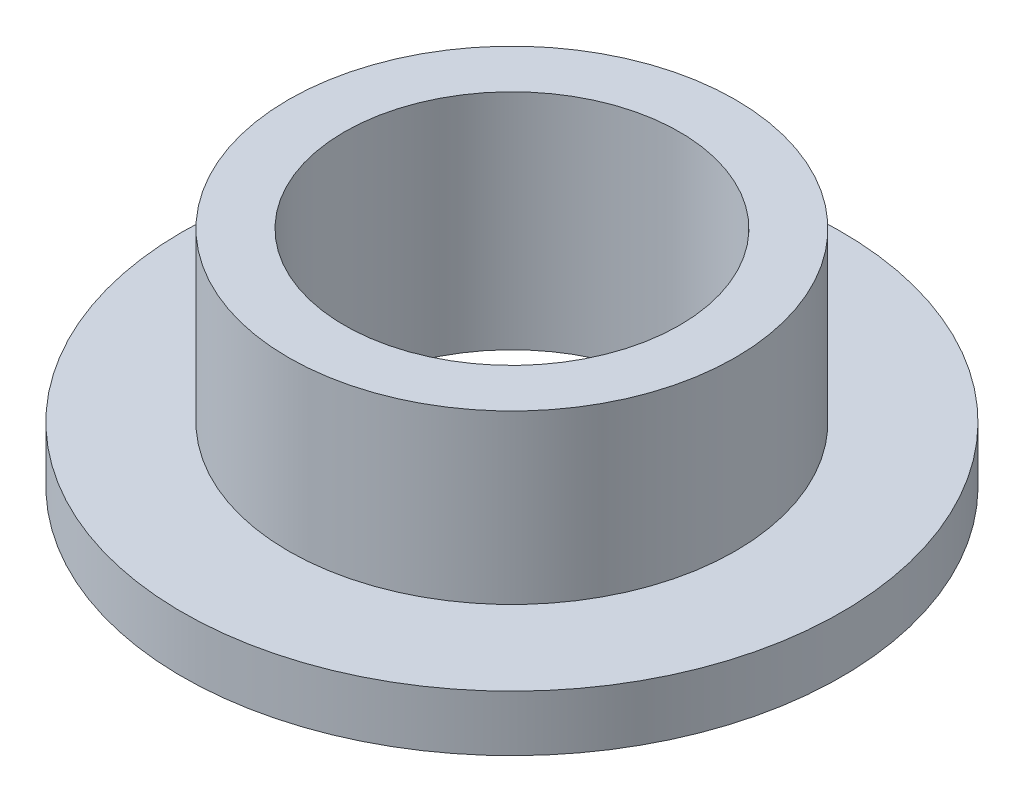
ISO-10303-21;
HEADER;
FILE_DESCRIPTION(('STEP AP214'),'2;1');
FILE_NAME('part.step','',(''),(''),'','','');
FILE_SCHEMA(('AUTOMOTIVE_DESIGN { 1 0 10303 214 1 1 1 1 }'));
ENDSEC;
DATA;
#1=APPLICATION_CONTEXT('core data for automotive mechanical design processes');
#2=APPLICATION_PROTOCOL_DEFINITION('international standard','automotive_design',2000,#1);
#3=PRODUCT_CONTEXT('',#1,'mechanical');
#4=PRODUCT('Part','Part','',(#3));
#5=PRODUCT_RELATED_PRODUCT_CATEGORY('part','',(#4));
#6=PRODUCT_DEFINITION_FORMATION('','',#4);
#7=PRODUCT_DEFINITION_CONTEXT('part definition',#1,'design');
#8=PRODUCT_DEFINITION('design','',#6,#7);
#9=PRODUCT_DEFINITION_SHAPE('','',#8);
#10=(LENGTH_UNIT() NAMED_UNIT(*) SI_UNIT(.MILLI.,.METRE.));
#11=(NAMED_UNIT(*) PLANE_ANGLE_UNIT() SI_UNIT($,.RADIAN.));
#12=(NAMED_UNIT(*) SI_UNIT($,.STERADIAN.) SOLID_ANGLE_UNIT());
#13=UNCERTAINTY_MEASURE_WITH_UNIT(LENGTH_MEASURE(1.E-05),#10,'distance_accuracy_value','');
#14=(GEOMETRIC_REPRESENTATION_CONTEXT(3) GLOBAL_UNCERTAINTY_ASSIGNED_CONTEXT((#13)) GLOBAL_UNIT_ASSIGNED_CONTEXT((#10,
#11,#12)) REPRESENTATION_CONTEXT('',''));
#15=CARTESIAN_POINT('',(0.,0.,0.));
#16=DIRECTION('',(0.,0.,1.));
#17=DIRECTION('',(1.,0.,0.));
#18=AXIS2_PLACEMENT_3D('',#15,#16,#17);
#19=CARTESIAN_POINT('',(0.,25.2722865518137,0.));
#20=DIRECTION('',(0.,1.,0.));
#21=DIRECTION('',(-1.,0.,0.));
#22=AXIS2_PLACEMENT_3D('',#19,#20,#21);
#23=CYLINDRICAL_SURFACE('',#22,2.);
#24=CARTESIAN_POINT('',(0.,1.5,0.));
#25=DIRECTION('',(0.,1.,0.));
#26=DIRECTION('',(-1.,0.,0.));
#27=AXIS2_PLACEMENT_3D('',#24,#25,#26);
#28=CIRCLE('',#27,2.);
#29=CARTESIAN_POINT('',(-2.,1.5,0.));
#30=VERTEX_POINT('',#29);
#31=EDGE_CURVE('E10',#30,#30,#28,.T.);
#32=ORIENTED_EDGE('',*,*,#31,.F.);
#33=EDGE_LOOP('',(#32));
#34=FACE_BOUND('',#33,.T.);
#35=CARTESIAN_POINT('',(0.,0.,0.));
#36=DIRECTION('',(0.,1.,0.));
#37=DIRECTION('',(-1.,0.,0.));
#38=AXIS2_PLACEMENT_3D('',#35,#36,#37);
#39=CIRCLE('',#38,2.);
#40=CARTESIAN_POINT('',(-2.,0.,0.));
#41=VERTEX_POINT('',#40);
#42=EDGE_CURVE('E64',#41,#41,#39,.T.);
#43=ORIENTED_EDGE('',*,*,#42,.T.);
#44=EDGE_LOOP('',(#43));
#45=FACE_BOUND('',#44,.T.);
#46=ADVANCED_FACE('F37',(#34,#45),#23,.T.);
#47=CARTESIAN_POINT('',(1.5,1.5,0.));
#48=DIRECTION('',(0.,-1.,0.));
#49=DIRECTION('',(1.,0.,0.));
#50=AXIS2_PLACEMENT_3D('',#47,#48,#49);
#51=PLANE('',#50);
#52=CARTESIAN_POINT('',(0.,1.5,0.));
#53=DIRECTION('',(0.,1.,0.));
#54=DIRECTION('',(-1.,0.,0.));
#55=AXIS2_PLACEMENT_3D('',#52,#53,#54);
#56=CIRCLE('',#55,1.5);
#57=CARTESIAN_POINT('',(-1.5,1.5,0.));
#58=VERTEX_POINT('',#57);
#59=EDGE_CURVE('E44',#58,#58,#56,.T.);
#60=ORIENTED_EDGE('',*,*,#59,.F.);
#61=EDGE_LOOP('',(#60));
#62=FACE_BOUND('',#61,.T.);
#63=ORIENTED_EDGE('',*,*,#31,.T.);
#64=EDGE_LOOP('',(#63));
#65=FACE_BOUND('',#64,.T.);
#66=ADVANCED_FACE('F90',(#62,#65),#51,.F.);
#67=CARTESIAN_POINT('',(0.,25.2722865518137,0.));
#68=DIRECTION('',(0.,1.,0.));
#69=DIRECTION('',(-1.,0.,0.));
#70=AXIS2_PLACEMENT_3D('',#67,#68,#69);
#71=CYLINDRICAL_SURFACE('',#70,1.5);
#72=CARTESIAN_POINT('',(0.,-0.5,0.));
#73=DIRECTION('',(0.,1.,0.));
#74=DIRECTION('',(-1.,0.,0.));
#75=AXIS2_PLACEMENT_3D('',#72,#73,#74);
#76=CIRCLE('',#75,1.5);
#77=CARTESIAN_POINT('',(-1.5,-0.500000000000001,0.));
#78=VERTEX_POINT('',#77);
#79=EDGE_CURVE('E49',#78,#78,#76,.T.);
#80=ORIENTED_EDGE('',*,*,#79,.F.);
#81=EDGE_LOOP('',(#80));
#82=FACE_BOUND('',#81,.T.);
#83=ORIENTED_EDGE('',*,*,#59,.T.);
#84=EDGE_LOOP('',(#83));
#85=FACE_BOUND('',#84,.T.);
#86=ADVANCED_FACE('F85',(#82,#85),#71,.F.);
#87=CARTESIAN_POINT('',(2.95,-0.5,0.));
#88=DIRECTION('',(0.,1.,0.));
#89=DIRECTION('',(-1.,0.,0.));
#90=AXIS2_PLACEMENT_3D('',#87,#88,#89);
#91=PLANE('',#90);
#92=CARTESIAN_POINT('',(0.,-0.5,0.));
#93=DIRECTION('',(0.,1.,0.));
#94=DIRECTION('',(-1.,0.,0.));
#95=AXIS2_PLACEMENT_3D('',#92,#93,#94);
#96=CIRCLE('',#95,2.95);
#97=CARTESIAN_POINT('',(-2.95,-0.500000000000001,0.));
#98=VERTEX_POINT('',#97);
#99=EDGE_CURVE('E54',#98,#98,#96,.T.);
#100=ORIENTED_EDGE('',*,*,#99,.F.);
#101=EDGE_LOOP('',(#100));
#102=FACE_BOUND('',#101,.T.);
#103=ORIENTED_EDGE('',*,*,#79,.T.);
#104=EDGE_LOOP('',(#103));
#105=FACE_BOUND('',#104,.T.);
#106=ADVANCED_FACE('F79',(#102,#105),#91,.F.);
#107=CARTESIAN_POINT('',(0.,25.2722865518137,0.));
#108=DIRECTION('',(0.,1.,0.));
#109=DIRECTION('',(-1.,0.,0.));
#110=AXIS2_PLACEMENT_3D('',#107,#108,#109);
#111=CYLINDRICAL_SURFACE('',#110,2.95);
#112=CARTESIAN_POINT('',(0.,0.,0.));
#113=DIRECTION('',(0.,1.,0.));
#114=DIRECTION('',(-1.,0.,0.));
#115=AXIS2_PLACEMENT_3D('',#112,#113,#114);
#116=CIRCLE('',#115,2.95);
#117=CARTESIAN_POINT('',(-2.95,0.,0.));
#118=VERTEX_POINT('',#117);
#119=EDGE_CURVE('E60',#118,#118,#116,.T.);
#120=ORIENTED_EDGE('',*,*,#119,.F.);
#121=EDGE_LOOP('',(#120));
#122=FACE_BOUND('',#121,.T.);
#123=ORIENTED_EDGE('',*,*,#99,.T.);
#124=EDGE_LOOP('',(#123));
#125=FACE_BOUND('',#124,.T.);
#126=ADVANCED_FACE('F73',(#122,#125),#111,.T.);
#127=CARTESIAN_POINT('',(2.,0.,0.));
#128=DIRECTION('',(0.,-1.,0.));
#129=DIRECTION('',(1.,0.,0.));
#130=AXIS2_PLACEMENT_3D('',#127,#128,#129);
#131=PLANE('',#130);
#132=ORIENTED_EDGE('',*,*,#42,.F.);
#133=EDGE_LOOP('',(#132));
#134=FACE_BOUND('',#133,.T.);
#135=ORIENTED_EDGE('',*,*,#119,.T.);
#136=EDGE_LOOP('',(#135));
#137=FACE_BOUND('',#136,.T.);
#138=ADVANCED_FACE('F70',(#134,#137),#131,.F.);
#139=CLOSED_SHELL('',(#46,#66,#86,#106,#126,#138));
#140=MANIFOLD_SOLID_BREP('B2',#139);
#141=ADVANCED_BREP_SHAPE_REPRESENTATION('',(#18,#140),#14);
#142=SHAPE_DEFINITION_REPRESENTATION(#9,#141);
ENDSEC;
END-ISO-10303-21;
